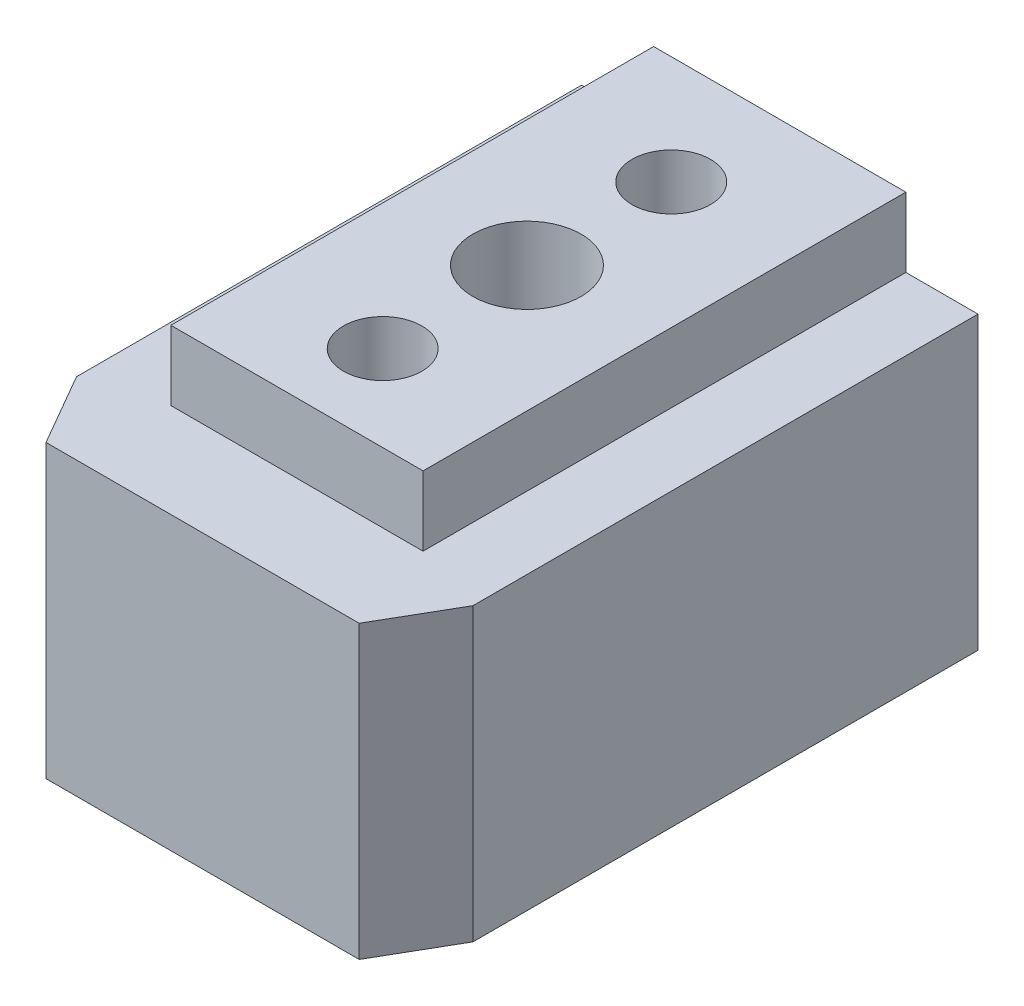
from build123d import *

# Parameters (mm, degrees)
SKETCH1_W                         = 17.4498
SKETCH1_H                         = 25.4
EXTRUDE1_DEPTH                    = 6.40715
SKETCH2_W                         = 11.0998
SKETCH2_H                         = 21.2471
EXTRUDE2_DEPTH                    = 3.0607
CHAMFER2_SIZE                     = 3.175
CHAMFER2_SIZE2                    = 1.833087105
CHAMFER3_SIZE                     = 3.175
CHAMFER3_SIZE2                    = 1.833087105
F_8_32_FINGER_MOUNT_HOLES_D       = 3.4544
F_8_32_FINGER_MOUNT_HOLES_DEPTH   = 12.2936
F_8_32_FINGER_MOUNT_HOLES_TIP     = 1.037806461
SKETCH5_R                         = 2.38125
F_3_16_DOWEL_HOLE_SLIP_FIT_DEPTH  = 9.525
F_8_32_FINGER_MOUNT_HOLES_2_D     = 3.4544
F_8_32_FINGER_MOUNT_HOLES_2_DEPTH = 12.2940064
F_8_32_FINGER_MOUNT_HOLES_2_TIP   = 1.037806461
SKETCH9_R                         = 1.5875
F_1_8_DOWEL_HOLES_SLIP_FIT_DEPTH  = 9.525


with BuildPart() as part:
    # Sketch1 → Extrude1 (new, symmetric)
    with BuildSketch(Plane(origin=(0, 0, 0), x_dir=(1, 0, 0), z_dir=(0, 1, 0))):
        Rectangle(SKETCH1_W, SKETCH1_H)
    extrude(amount=EXTRUDE1_DEPTH, both=True)

    # Sketch2 → Extrude2 (add)
    with BuildSketch(Plane(origin=(0, 6.40715, 0), x_dir=(-1, 0, 0), z_dir=(0, 1, 0))):
        with Locations((0, -2.07645)):
            Rectangle(SKETCH2_W, SKETCH2_H)
    extrude(amount=EXTRUDE2_DEPTH)

    # Chamfer2
    chamfer2_edges = [part.edges().sort_by_distance(p)[0] for p in [
        (8.7249, 0, 12.7),
    ]]
    chamfer2_side = [part.faces().sort_by_distance(p)[0] for p in [
        (8.7249, 0, 0),
    ]]
    chamfer(chamfer2_edges, length=CHAMFER2_SIZE, length2=CHAMFER2_SIZE2, reference=chamfer2_side[0])

    # Chamfer3
    chamfer3_edges = [part.edges().sort_by_distance(p)[0] for p in [
        (-8.7249, 0, 12.7),
    ]]
    chamfer3_side = [part.faces().sort_by_distance(p)[0] for p in [
        (-8.7249, 0, 0),
    ]]
    chamfer(chamfer3_edges, length=CHAMFER3_SIZE, length2=CHAMFER3_SIZE2, reference=chamfer3_side[0])

    # 8-32 _Finger Mount Holes
    with Locations(Plane(origin=(0, 9.46785, 0), x_dir=(-1, 0, 0), z_dir=(0, 1, 0))):
        with Locations((0, 4.7752), (0, -7.9248)):
            Hole(F_8_32_FINGER_MOUNT_HOLES_D / 2, depth=F_8_32_FINGER_MOUNT_HOLES_DEPTH)
            with Locations((0, 0, -(F_8_32_FINGER_MOUNT_HOLES_DEPTH + F_8_32_FINGER_MOUNT_HOLES_TIP / 2))):  # 118° drill point
                Cone(0, F_8_32_FINGER_MOUNT_HOLES_D / 2, F_8_32_FINGER_MOUNT_HOLES_TIP, mode=Mode.SUBTRACT)

    # Sketch5 → 3_16 Dowel Hole - Slip Fit (cut)
    with BuildSketch(Plane(origin=(0, 9.46785, 0), x_dir=(-1, 0, 0), z_dir=(0, 1, 0))):
        with Locations(Location((0, -1.5748, 0), (0, 0, 90))):
            Circle(SKETCH5_R)
    extrude(amount=-F_3_16_DOWEL_HOLE_SLIP_FIT_DEPTH, mode=Mode.SUBTRACT)

    # 8-32 _Finger Mount Holes 2
    with Locations(Plane(origin=(0, 0, -12.7), x_dir=(-1, 0, 0), z_dir=(0, 0, -1))):
        with Locations((-5.55498, 3.11785), (5.55498, 3.11785)):
            Hole(F_8_32_FINGER_MOUNT_HOLES_2_D / 2, depth=F_8_32_FINGER_MOUNT_HOLES_2_DEPTH)
            with Locations((0, 0, -(F_8_32_FINGER_MOUNT_HOLES_2_DEPTH + F_8_32_FINGER_MOUNT_HOLES_2_TIP / 2))):  # 118° drill point
                Cone(0, F_8_32_FINGER_MOUNT_HOLES_2_D / 2, F_8_32_FINGER_MOUNT_HOLES_2_TIP, mode=Mode.SUBTRACT)

    # Sketch9 → 1_8 Dowel Holes - Slip Fit (cut)
    with BuildSketch(Plane(origin=(0, 0, -12.7), x_dir=(-1, 0, 0), z_dir=(0, 0, -1))):
        with Locations((-5.55498, -3.23215)):
            Circle(SKETCH9_R)
        with Locations((5.55498, -3.23215)):
            Circle(SKETCH9_R)
    extrude(amount=-F_1_8_DOWEL_HOLES_SLIP_FIT_DEPTH, mode=Mode.SUBTRACT)


solid = part.part
